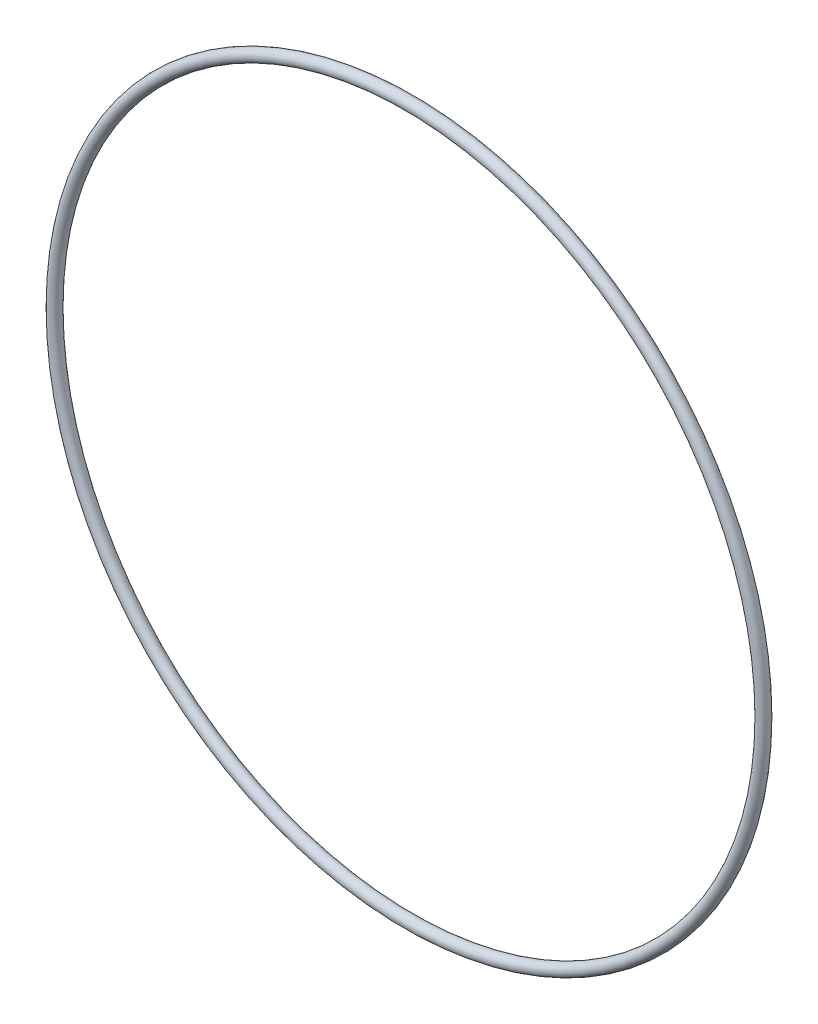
ISO-10303-21;
HEADER;
FILE_DESCRIPTION(('STEP AP214'),'2;1');
FILE_NAME('part.step','',(''),(''),'','','');
FILE_SCHEMA(('AUTOMOTIVE_DESIGN { 1 0 10303 214 1 1 1 1 }'));
ENDSEC;
DATA;
#1=APPLICATION_CONTEXT('core data for automotive mechanical design processes');
#2=APPLICATION_PROTOCOL_DEFINITION('international standard','automotive_design',2000,#1);
#3=PRODUCT_CONTEXT('',#1,'mechanical');
#4=PRODUCT('Part','Part','',(#3));
#5=PRODUCT_RELATED_PRODUCT_CATEGORY('part','',(#4));
#6=PRODUCT_DEFINITION_FORMATION('','',#4);
#7=PRODUCT_DEFINITION_CONTEXT('part definition',#1,'design');
#8=PRODUCT_DEFINITION('design','',#6,#7);
#9=PRODUCT_DEFINITION_SHAPE('','',#8);
#10=(LENGTH_UNIT() NAMED_UNIT(*) SI_UNIT(.MILLI.,.METRE.));
#11=(NAMED_UNIT(*) PLANE_ANGLE_UNIT() SI_UNIT($,.RADIAN.));
#12=(NAMED_UNIT(*) SI_UNIT($,.STERADIAN.) SOLID_ANGLE_UNIT());
#13=UNCERTAINTY_MEASURE_WITH_UNIT(LENGTH_MEASURE(1.E-05),#10,'distance_accuracy_value','');
#14=(GEOMETRIC_REPRESENTATION_CONTEXT(3) GLOBAL_UNCERTAINTY_ASSIGNED_CONTEXT((#13)) GLOBAL_UNIT_ASSIGNED_CONTEXT((#10,
#11,#12)) REPRESENTATION_CONTEXT('',''));
#15=CARTESIAN_POINT('',(0.,0.,0.));
#16=DIRECTION('',(0.,0.,1.));
#17=DIRECTION('',(1.,0.,0.));
#18=AXIS2_PLACEMENT_3D('',#15,#16,#17);
#19=CARTESIAN_POINT('',(0.,0.,0.));
#20=DIRECTION('',(0.,0.,1.));
#21=DIRECTION('',(1.,0.,0.));
#22=AXIS2_PLACEMENT_3D('',#19,#20,#21);
#23=TOROIDAL_SURFACE('',#22,77.343,1.3081);
#24=ADVANCED_FACE('F22',(),#23,.T.);
#25=CLOSED_SHELL('',(#24));
#26=MANIFOLD_SOLID_BREP('B1',#25);
#27=ADVANCED_BREP_SHAPE_REPRESENTATION('',(#18,#26),#14);
#28=SHAPE_DEFINITION_REPRESENTATION(#9,#27);
ENDSEC;
END-ISO-10303-21;
